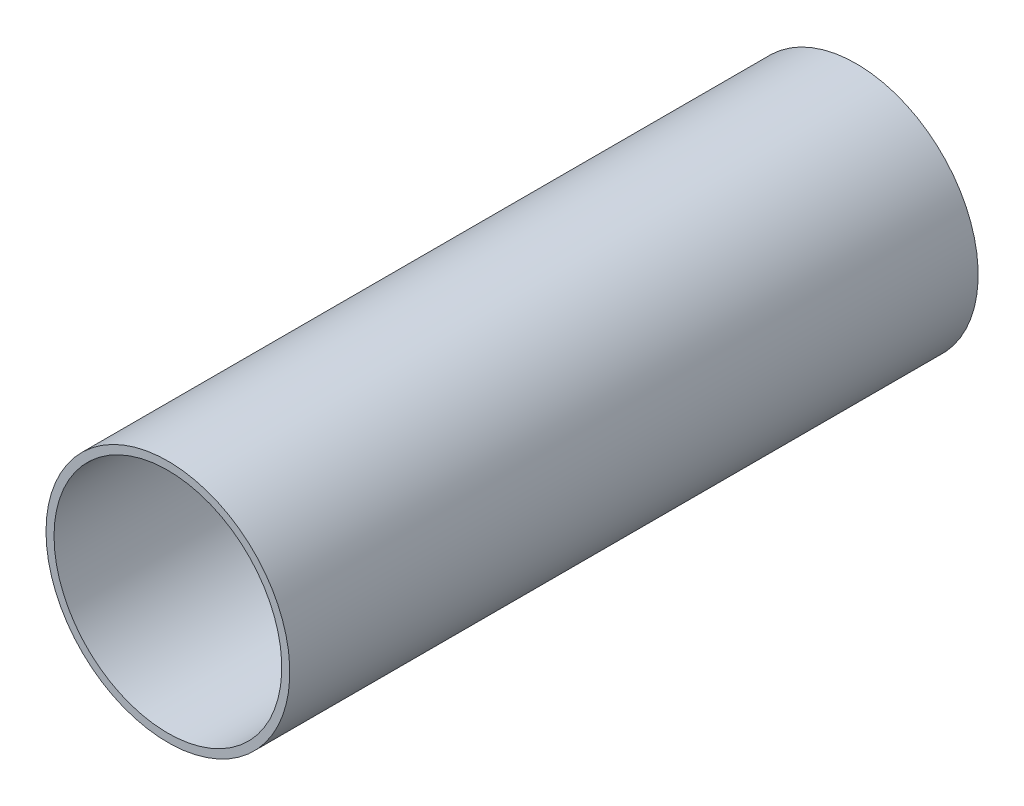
ISO-10303-21;
HEADER;
FILE_DESCRIPTION(('STEP AP214'),'2;1');
FILE_NAME('part.step','',(''),(''),'','','');
FILE_SCHEMA(('AUTOMOTIVE_DESIGN { 1 0 10303 214 1 1 1 1 }'));
ENDSEC;
DATA;
#1=APPLICATION_CONTEXT('core data for automotive mechanical design processes');
#2=APPLICATION_PROTOCOL_DEFINITION('international standard','automotive_design',2000,#1);
#3=PRODUCT_CONTEXT('',#1,'mechanical');
#4=PRODUCT('Part','Part','',(#3));
#5=PRODUCT_RELATED_PRODUCT_CATEGORY('part','',(#4));
#6=PRODUCT_DEFINITION_FORMATION('','',#4);
#7=PRODUCT_DEFINITION_CONTEXT('part definition',#1,'design');
#8=PRODUCT_DEFINITION('design','',#6,#7);
#9=PRODUCT_DEFINITION_SHAPE('','',#8);
#10=(LENGTH_UNIT() NAMED_UNIT(*) SI_UNIT(.MILLI.,.METRE.));
#11=(NAMED_UNIT(*) PLANE_ANGLE_UNIT() SI_UNIT($,.RADIAN.));
#12=(NAMED_UNIT(*) SI_UNIT($,.STERADIAN.) SOLID_ANGLE_UNIT());
#13=UNCERTAINTY_MEASURE_WITH_UNIT(LENGTH_MEASURE(1.E-05),#10,'distance_accuracy_value','');
#14=(GEOMETRIC_REPRESENTATION_CONTEXT(3) GLOBAL_UNCERTAINTY_ASSIGNED_CONTEXT((#13)) GLOBAL_UNIT_ASSIGNED_CONTEXT((#10,
#11,#12)) REPRESENTATION_CONTEXT('',''));
#15=CARTESIAN_POINT('',(0.,0.,0.));
#16=DIRECTION('',(0.,0.,1.));
#17=DIRECTION('',(1.,0.,0.));
#18=AXIS2_PLACEMENT_3D('',#15,#16,#17);
#19=CARTESIAN_POINT('',(0.,0.,152.4));
#20=DIRECTION('',(0.,0.,1.));
#21=DIRECTION('',(1.,0.,0.));
#22=AXIS2_PLACEMENT_3D('',#19,#20,#21);
#23=PLANE('',#22);
#24=CARTESIAN_POINT('',(0.,0.,152.4));
#25=DIRECTION('',(0.,0.,1.));
#26=DIRECTION('',(1.,0.,0.));
#27=AXIS2_PLACEMENT_3D('',#24,#25,#26);
#28=CIRCLE('',#27,26.9875);
#29=CARTESIAN_POINT('',(-26.9875,0.,152.4));
#30=VERTEX_POINT('',#29);
#31=EDGE_CURVE('E10',#30,#30,#28,.T.);
#32=ORIENTED_EDGE('',*,*,#31,.T.);
#33=EDGE_LOOP('',(#32));
#34=FACE_BOUND('',#33,.T.);
#35=CARTESIAN_POINT('',(0.,0.,152.4));
#36=DIRECTION('',(0.,0.,1.));
#37=DIRECTION('',(1.,0.,0.));
#38=AXIS2_PLACEMENT_3D('',#35,#36,#37);
#39=CIRCLE('',#38,25.2095);
#40=CARTESIAN_POINT('',(-25.2095,0.,152.4));
#41=VERTEX_POINT('',#40);
#42=EDGE_CURVE('E50',#41,#41,#39,.T.);
#43=ORIENTED_EDGE('',*,*,#42,.F.);
#44=EDGE_LOOP('',(#43));
#45=FACE_BOUND('',#44,.T.);
#46=ADVANCED_FACE('F37',(#34,#45),#23,.T.);
#47=CARTESIAN_POINT('',(0.,0.,0.));
#48=DIRECTION('',(0.,0.,1.));
#49=DIRECTION('',(1.,0.,0.));
#50=AXIS2_PLACEMENT_3D('',#47,#48,#49);
#51=PLANE('',#50);
#52=CARTESIAN_POINT('',(0.,0.,0.));
#53=DIRECTION('',(0.,0.,1.));
#54=DIRECTION('',(1.,0.,0.));
#55=AXIS2_PLACEMENT_3D('',#52,#53,#54);
#56=CIRCLE('',#55,26.9875);
#57=CARTESIAN_POINT('',(-26.9875,0.,0.));
#58=VERTEX_POINT('',#57);
#59=EDGE_CURVE('E41',#58,#58,#56,.T.);
#60=ORIENTED_EDGE('',*,*,#59,.F.);
#61=EDGE_LOOP('',(#60));
#62=FACE_BOUND('',#61,.T.);
#63=CARTESIAN_POINT('',(0.,0.,0.));
#64=DIRECTION('',(0.,0.,1.));
#65=DIRECTION('',(1.,0.,0.));
#66=AXIS2_PLACEMENT_3D('',#63,#64,#65);
#67=CIRCLE('',#66,25.2095);
#68=CARTESIAN_POINT('',(-25.2095,0.,0.));
#69=VERTEX_POINT('',#68);
#70=EDGE_CURVE('E52',#69,#69,#67,.T.);
#71=ORIENTED_EDGE('',*,*,#70,.T.);
#72=EDGE_LOOP('',(#71));
#73=FACE_BOUND('',#72,.T.);
#74=ADVANCED_FACE('F64',(#62,#73),#51,.F.);
#75=CARTESIAN_POINT('',(0.,0.,152.4));
#76=DIRECTION('',(0.,0.,-1.));
#77=DIRECTION('',(-1.,0.,0.));
#78=AXIS2_PLACEMENT_3D('',#75,#76,#77);
#79=CYLINDRICAL_SURFACE('',#78,26.9875);
#80=CARTESIAN_POINT('',(-26.9875,0.,152.4));
#81=CARTESIAN_POINT('',(-26.9875,0.,150.8125));
#82=CARTESIAN_POINT('',(-26.9875,0.,149.225));
#83=CARTESIAN_POINT('',(-26.9875,0.,146.05));
#84=CARTESIAN_POINT('',(-26.9875,0.,144.4625));
#85=CARTESIAN_POINT('',(-26.9875,0.,141.2875));
#86=CARTESIAN_POINT('',(-26.9875,0.,139.7));
#87=CARTESIAN_POINT('',(-26.9875,0.,136.525));
#88=CARTESIAN_POINT('',(-26.9875,0.,134.9375));
#89=CARTESIAN_POINT('',(-26.9875,0.,131.7625));
#90=CARTESIAN_POINT('',(-26.9875,0.,130.175));
#91=CARTESIAN_POINT('',(-26.9875,0.,127.));
#92=CARTESIAN_POINT('',(-26.9875,0.,125.4125));
#93=CARTESIAN_POINT('',(-26.9875,0.,122.2375));
#94=CARTESIAN_POINT('',(-26.9875,0.,120.65));
#95=CARTESIAN_POINT('',(-26.9875,0.,117.475));
#96=CARTESIAN_POINT('',(-26.9875,0.,115.8875));
#97=CARTESIAN_POINT('',(-26.9875,0.,112.7125));
#98=CARTESIAN_POINT('',(-26.9875,0.,111.125));
#99=CARTESIAN_POINT('',(-26.9875,0.,107.95));
#100=CARTESIAN_POINT('',(-26.9875,0.,106.3625));
#101=CARTESIAN_POINT('',(-26.9875,0.,103.1875));
#102=CARTESIAN_POINT('',(-26.9875,0.,101.6));
#103=CARTESIAN_POINT('',(-26.9875,0.,98.425));
#104=CARTESIAN_POINT('',(-26.9875,0.,96.8375));
#105=CARTESIAN_POINT('',(-26.9875,0.,93.6625));
#106=CARTESIAN_POINT('',(-26.9875,0.,92.075));
#107=CARTESIAN_POINT('',(-26.9875,0.,88.9));
#108=CARTESIAN_POINT('',(-26.9875,0.,87.3125));
#109=CARTESIAN_POINT('',(-26.9875,0.,84.1375));
#110=CARTESIAN_POINT('',(-26.9875,0.,82.55));
#111=CARTESIAN_POINT('',(-26.9875,0.,79.375));
#112=CARTESIAN_POINT('',(-26.9875,0.,77.7875));
#113=CARTESIAN_POINT('',(-26.9875,0.,74.6125));
#114=CARTESIAN_POINT('',(-26.9875,0.,73.025));
#115=CARTESIAN_POINT('',(-26.9875,0.,69.85));
#116=CARTESIAN_POINT('',(-26.9875,0.,68.2625));
#117=CARTESIAN_POINT('',(-26.9875,0.,65.0875));
#118=CARTESIAN_POINT('',(-26.9875,0.,63.5));
#119=CARTESIAN_POINT('',(-26.9875,0.,60.325));
#120=CARTESIAN_POINT('',(-26.9875,0.,58.7375));
#121=CARTESIAN_POINT('',(-26.9875,0.,55.5625));
#122=CARTESIAN_POINT('',(-26.9875,0.,53.975));
#123=CARTESIAN_POINT('',(-26.9875,0.,50.8));
#124=CARTESIAN_POINT('',(-26.9875,0.,49.2125));
#125=CARTESIAN_POINT('',(-26.9875,0.,46.0375));
#126=CARTESIAN_POINT('',(-26.9875,0.,44.45));
#127=CARTESIAN_POINT('',(-26.9875,0.,41.275));
#128=CARTESIAN_POINT('',(-26.9875,0.,39.6875));
#129=CARTESIAN_POINT('',(-26.9875,0.,36.5125));
#130=CARTESIAN_POINT('',(-26.9875,0.,34.925));
#131=CARTESIAN_POINT('',(-26.9875,0.,31.75));
#132=CARTESIAN_POINT('',(-26.9875,0.,30.1625));
#133=CARTESIAN_POINT('',(-26.9875,0.,26.9875));
#134=CARTESIAN_POINT('',(-26.9875,0.,25.4));
#135=CARTESIAN_POINT('',(-26.9875,0.,22.225));
#136=CARTESIAN_POINT('',(-26.9875,0.,20.6375));
#137=CARTESIAN_POINT('',(-26.9875,0.,17.4625));
#138=CARTESIAN_POINT('',(-26.9875,0.,15.875));
#139=CARTESIAN_POINT('',(-26.9875,0.,12.7));
#140=CARTESIAN_POINT('',(-26.9875,0.,11.1125));
#141=CARTESIAN_POINT('',(-26.9875,0.,7.93750000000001));
#142=CARTESIAN_POINT('',(-26.9875,0.,6.35));
#143=CARTESIAN_POINT('',(-26.9875,0.,3.175));
#144=CARTESIAN_POINT('',(-26.9875,0.,1.5875));
#145=CARTESIAN_POINT('',(-26.9875,0.,0.));
#146=B_SPLINE_CURVE_WITH_KNOTS('',3,(#80,#81,#82,#83,#84,#85,#86,#87,#88,#89,#90,#91,#92,#93,
#94,#95,#96,#97,#98,#99,#100,#101,#102,#103,#104,#105,#106,#107,#108,#109,#110,#111,#112,#113,
#114,#115,#116,#117,#118,#119,#120,#121,#122,#123,#124,#125,#126,#127,#128,#129,#130,#131,#132,
#133,#134,#135,#136,#137,#138,#139,#140,#141,#142,#143,#144,#145),.UNSPECIFIED.,.F.,.F.,(4,2,2,
2,2,2,2,2,2,2,2,2,2,2,2,2,2,2,2,2,2,2,2,2,2,2,2,2,2,2,2,2,4),(0.,4.7625,9.52500000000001,
14.2875,19.05,23.8125,28.575,33.3375,38.1,42.8625,47.625,52.3875,57.15,61.9125,66.675,71.4375,
76.2,80.9625,85.725,90.4875,95.25,100.0125,104.775,109.5375,114.3,119.0625,123.825,128.5875,
133.35,138.1125,142.875,147.6375,152.4),.UNSPECIFIED.);
#147=EDGE_CURVE('BSEAM39',#30,#58,#146,.T.);
#148=ORIENTED_EDGE('',*,*,#31,.F.);
#149=ORIENTED_EDGE('',*,*,#59,.T.);
#150=ORIENTED_EDGE('',*,*,#147,.T.);
#151=ORIENTED_EDGE('',*,*,#147,.F.);
#152=EDGE_LOOP('',(#148,#150,#149,#151));
#153=FACE_BOUND('',#152,.T.);
#154=ADVANCED_FACE('F39',(#153),#79,.T.);
#155=CARTESIAN_POINT('',(0.,0.,152.4));
#156=DIRECTION('',(0.,0.,-1.));
#157=DIRECTION('',(-1.,0.,0.));
#158=AXIS2_PLACEMENT_3D('',#155,#156,#157);
#159=CYLINDRICAL_SURFACE('',#158,25.2095);
#160=CARTESIAN_POINT('',(-25.2095,0.,152.4));
#161=CARTESIAN_POINT('',(-25.2095,0.,150.8125));
#162=CARTESIAN_POINT('',(-25.2095,0.,149.225));
#163=CARTESIAN_POINT('',(-25.2095,0.,146.05));
#164=CARTESIAN_POINT('',(-25.2095,0.,144.4625));
#165=CARTESIAN_POINT('',(-25.2095,0.,141.2875));
#166=CARTESIAN_POINT('',(-25.2095,0.,139.7));
#167=CARTESIAN_POINT('',(-25.2095,0.,136.525));
#168=CARTESIAN_POINT('',(-25.2095,0.,134.9375));
#169=CARTESIAN_POINT('',(-25.2095,0.,131.7625));
#170=CARTESIAN_POINT('',(-25.2095,0.,130.175));
#171=CARTESIAN_POINT('',(-25.2095,0.,127.));
#172=CARTESIAN_POINT('',(-25.2095,0.,125.4125));
#173=CARTESIAN_POINT('',(-25.2095,0.,122.2375));
#174=CARTESIAN_POINT('',(-25.2095,0.,120.65));
#175=CARTESIAN_POINT('',(-25.2095,0.,117.475));
#176=CARTESIAN_POINT('',(-25.2095,0.,115.8875));
#177=CARTESIAN_POINT('',(-25.2095,0.,112.7125));
#178=CARTESIAN_POINT('',(-25.2095,0.,111.125));
#179=CARTESIAN_POINT('',(-25.2095,0.,107.95));
#180=CARTESIAN_POINT('',(-25.2095,0.,106.3625));
#181=CARTESIAN_POINT('',(-25.2095,0.,103.1875));
#182=CARTESIAN_POINT('',(-25.2095,0.,101.6));
#183=CARTESIAN_POINT('',(-25.2095,0.,98.425));
#184=CARTESIAN_POINT('',(-25.2095,0.,96.8375));
#185=CARTESIAN_POINT('',(-25.2095,0.,93.6625));
#186=CARTESIAN_POINT('',(-25.2095,0.,92.075));
#187=CARTESIAN_POINT('',(-25.2095,0.,88.9));
#188=CARTESIAN_POINT('',(-25.2095,0.,87.3125));
#189=CARTESIAN_POINT('',(-25.2095,0.,84.1375));
#190=CARTESIAN_POINT('',(-25.2095,0.,82.55));
#191=CARTESIAN_POINT('',(-25.2095,0.,79.375));
#192=CARTESIAN_POINT('',(-25.2095,0.,77.7875));
#193=CARTESIAN_POINT('',(-25.2095,0.,74.6125));
#194=CARTESIAN_POINT('',(-25.2095,0.,73.025));
#195=CARTESIAN_POINT('',(-25.2095,0.,69.85));
#196=CARTESIAN_POINT('',(-25.2095,0.,68.2625));
#197=CARTESIAN_POINT('',(-25.2095,0.,65.0875));
#198=CARTESIAN_POINT('',(-25.2095,0.,63.5));
#199=CARTESIAN_POINT('',(-25.2095,0.,60.325));
#200=CARTESIAN_POINT('',(-25.2095,0.,58.7375));
#201=CARTESIAN_POINT('',(-25.2095,0.,55.5625));
#202=CARTESIAN_POINT('',(-25.2095,0.,53.975));
#203=CARTESIAN_POINT('',(-25.2095,0.,50.8));
#204=CARTESIAN_POINT('',(-25.2095,0.,49.2125));
#205=CARTESIAN_POINT('',(-25.2095,0.,46.0375));
#206=CARTESIAN_POINT('',(-25.2095,0.,44.45));
#207=CARTESIAN_POINT('',(-25.2095,0.,41.275));
#208=CARTESIAN_POINT('',(-25.2095,0.,39.6875));
#209=CARTESIAN_POINT('',(-25.2095,0.,36.5125));
#210=CARTESIAN_POINT('',(-25.2095,0.,34.925));
#211=CARTESIAN_POINT('',(-25.2095,0.,31.75));
#212=CARTESIAN_POINT('',(-25.2095,0.,30.1625));
#213=CARTESIAN_POINT('',(-25.2095,0.,26.9875));
#214=CARTESIAN_POINT('',(-25.2095,0.,25.4));
#215=CARTESIAN_POINT('',(-25.2095,0.,22.225));
#216=CARTESIAN_POINT('',(-25.2095,0.,20.6375));
#217=CARTESIAN_POINT('',(-25.2095,0.,17.4625));
#218=CARTESIAN_POINT('',(-25.2095,0.,15.875));
#219=CARTESIAN_POINT('',(-25.2095,0.,12.7));
#220=CARTESIAN_POINT('',(-25.2095,0.,11.1125));
#221=CARTESIAN_POINT('',(-25.2095,0.,7.93750000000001));
#222=CARTESIAN_POINT('',(-25.2095,0.,6.35));
#223=CARTESIAN_POINT('',(-25.2095,0.,3.175));
#224=CARTESIAN_POINT('',(-25.2095,0.,1.5875));
#225=CARTESIAN_POINT('',(-25.2095,0.,0.));
#226=B_SPLINE_CURVE_WITH_KNOTS('',3,(#160,#161,#162,#163,#164,#165,#166,#167,#168,#169,#170,
#171,#172,#173,#174,#175,#176,#177,#178,#179,#180,#181,#182,#183,#184,#185,#186,#187,#188,#189,
#190,#191,#192,#193,#194,#195,#196,#197,#198,#199,#200,#201,#202,#203,#204,#205,#206,#207,#208,
#209,#210,#211,#212,#213,#214,#215,#216,#217,#218,#219,#220,#221,#222,#223,#224,#225),
.UNSPECIFIED.,.F.,.F.,(4,2,2,2,2,2,2,2,2,2,2,2,2,2,2,2,2,2,2,2,2,2,2,2,2,2,2,2,2,2,2,2,4),(0.,
4.7625,9.52500000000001,14.2875,19.05,23.8125,28.575,33.3375,38.1,42.8625,47.625,52.3875,57.15,
61.9125,66.675,71.4375,76.2,80.9625,85.725,90.4875,95.25,100.0125,104.775,109.5375,114.3,
119.0625,123.825,128.5875,133.35,138.1125,142.875,147.6375,152.4),.UNSPECIFIED.);
#227=EDGE_CURVE('BSEAM60',#41,#69,#226,.T.);
#228=ORIENTED_EDGE('',*,*,#42,.T.);
#229=ORIENTED_EDGE('',*,*,#70,.F.);
#230=ORIENTED_EDGE('',*,*,#227,.T.);
#231=ORIENTED_EDGE('',*,*,#227,.F.);
#232=EDGE_LOOP('',(#228,#230,#229,#231));
#233=FACE_BOUND('',#232,.T.);
#234=ADVANCED_FACE('F60',(#233),#159,.F.);
#235=CLOSED_SHELL('',(#46,#74,#154,#234));
#236=MANIFOLD_SOLID_BREP('B2',#235);
#237=ADVANCED_BREP_SHAPE_REPRESENTATION('',(#18,#236),#14);
#238=SHAPE_DEFINITION_REPRESENTATION(#9,#237);
ENDSEC;
END-ISO-10303-21;
